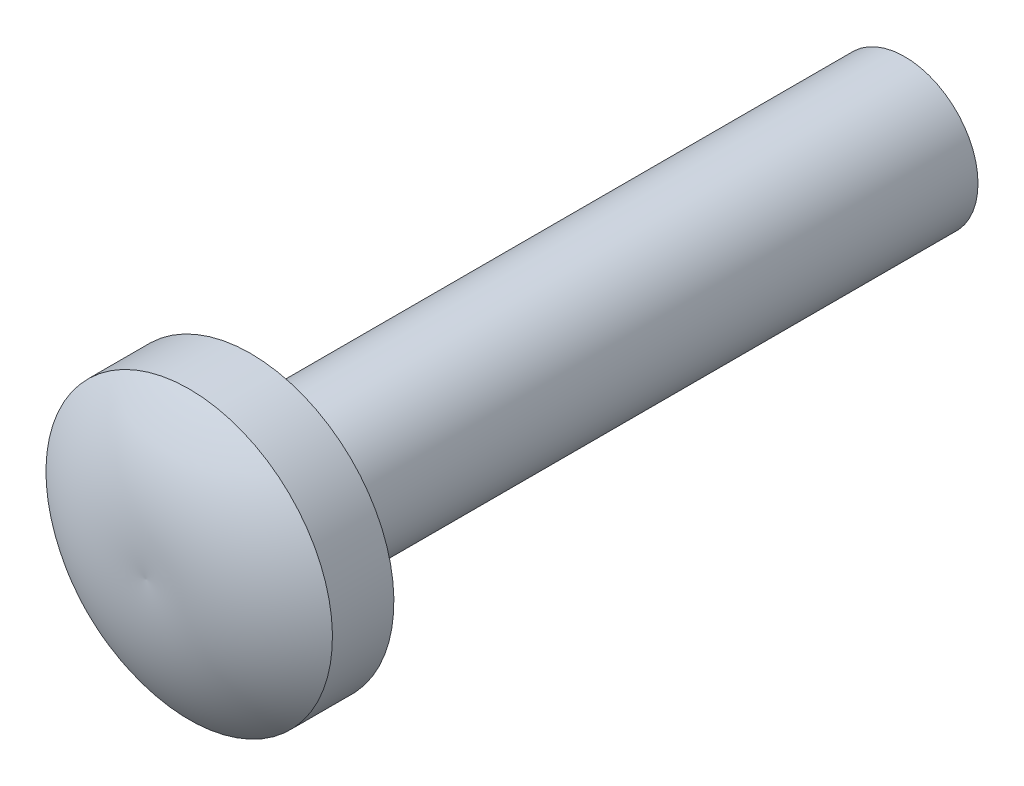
from build123d import *

# Parameters (mm, degrees)
SKETCH1_R           = 1.4224
BOSS_EXTRUDE1_DEPTH = 12.7


with BuildPart() as part:
    # Sketch1 → Boss-Extrude1 (new body)
    with BuildSketch(Plane.XY):
        Circle(SKETCH1_R)
    extrude(amount=BOSS_EXTRUDE1_DEPTH)

    # Sketch3 → Revolve1 (revolve)
    with BuildSketch(Plane(origin=(0, 0, 0), x_dir=(0, 0, -1), z_dir=(1, 0, 0))):
        with BuildLine():
            Line((-12.7, 0), (-14.732, 0))
            add(Edge.make_bspline(
                [(-13.893093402, 2.7813), (-14.870102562, 1.52671008), (-14.732, 0)],
                knots=[0, 0, 0, 1, 1, 1], degree=2))
            Line((-13.893093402, 2.7813), (-12.7, 2.7813))
            Line((-12.7, 2.7813), (-12.7, 0))
        make_face()
    revolve(axis=Axis((0, 0, 12.7), (0, 0, 1)))


solid = part.part
